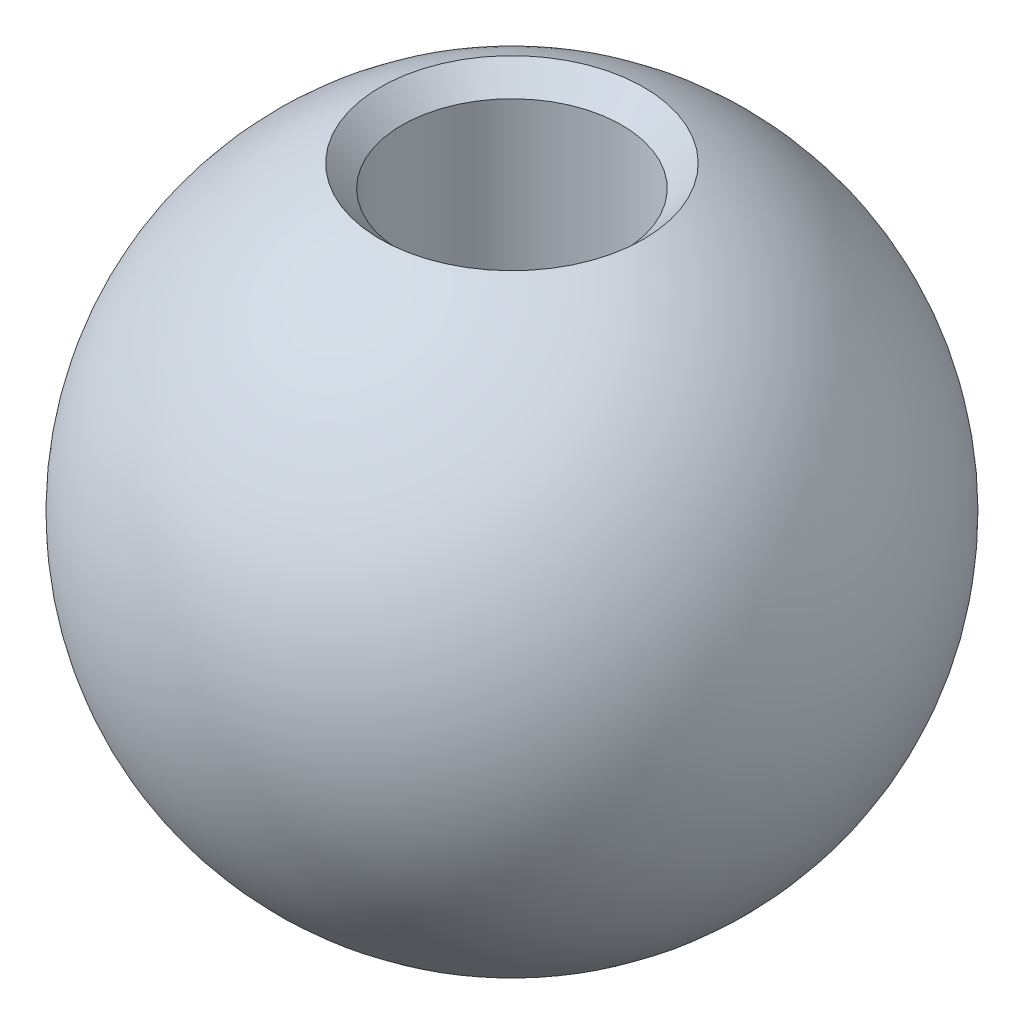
ISO-10303-21;
HEADER;
FILE_DESCRIPTION(('STEP AP214'),'2;1');
FILE_NAME('part.step','',(''),(''),'','','');
FILE_SCHEMA(('AUTOMOTIVE_DESIGN { 1 0 10303 214 1 1 1 1 }'));
ENDSEC;
DATA;
#1=APPLICATION_CONTEXT('core data for automotive mechanical design processes');
#2=APPLICATION_PROTOCOL_DEFINITION('international standard','automotive_design',2000,#1);
#3=PRODUCT_CONTEXT('',#1,'mechanical');
#4=PRODUCT('Part','Part','',(#3));
#5=PRODUCT_RELATED_PRODUCT_CATEGORY('part','',(#4));
#6=PRODUCT_DEFINITION_FORMATION('','',#4);
#7=PRODUCT_DEFINITION_CONTEXT('part definition',#1,'design');
#8=PRODUCT_DEFINITION('design','',#6,#7);
#9=PRODUCT_DEFINITION_SHAPE('','',#8);
#10=(LENGTH_UNIT() NAMED_UNIT(*) SI_UNIT(.MILLI.,.METRE.));
#11=(NAMED_UNIT(*) PLANE_ANGLE_UNIT() SI_UNIT($,.RADIAN.));
#12=(NAMED_UNIT(*) SI_UNIT($,.STERADIAN.) SOLID_ANGLE_UNIT());
#13=UNCERTAINTY_MEASURE_WITH_UNIT(LENGTH_MEASURE(1.E-05),#10,'distance_accuracy_value','');
#14=(GEOMETRIC_REPRESENTATION_CONTEXT(3) GLOBAL_UNCERTAINTY_ASSIGNED_CONTEXT((#13)) GLOBAL_UNIT_ASSIGNED_CONTEXT((#10,
#11,#12)) REPRESENTATION_CONTEXT('',''));
#15=CARTESIAN_POINT('',(0.,0.,0.));
#16=DIRECTION('',(0.,0.,1.));
#17=DIRECTION('',(1.,0.,0.));
#18=AXIS2_PLACEMENT_3D('',#15,#16,#17);
#19=CARTESIAN_POINT('',(0.,0.,0.));
#20=DIRECTION('',(0.,-1.,0.));
#21=DIRECTION('',(1.,0.,0.));
#22=AXIS2_PLACEMENT_3D('',#19,#20,#21);
#23=SPHERICAL_SURFACE('',#22,6.);
#24=CARTESIAN_POINT('',(0.,5.5,0.));
#25=DIRECTION('',(0.,-1.,0.));
#26=DIRECTION('',(1.,0.,0.));
#27=AXIS2_PLACEMENT_3D('',#24,#25,#26);
#28=CIRCLE('',#27,2.39791576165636);
#29=CARTESIAN_POINT('',(2.39791576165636,5.5,0.));
#30=VERTEX_POINT('',#29);
#31=EDGE_CURVE('E10',#30,#30,#28,.T.);
#32=CARTESIAN_POINT('',(0.,-5.5,0.));
#33=DIRECTION('',(0.,-1.,0.));
#34=DIRECTION('',(1.,0.,0.));
#35=AXIS2_PLACEMENT_3D('',#32,#33,#34);
#36=CIRCLE('',#35,2.39791576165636);
#37=CARTESIAN_POINT('',(2.39791576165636,-5.5,0.));
#38=VERTEX_POINT('',#37);
#39=EDGE_CURVE('E45',#38,#38,#36,.T.);
#40=CARTESIAN_POINT('',(2.39791576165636,5.5,0.));
#41=CARTESIAN_POINT('',(2.53079788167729,5.44207621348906,0.));
#42=CARTESIAN_POINT('',(2.66157166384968,5.37931973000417,0.));
#43=CARTESIAN_POINT('',(2.9182361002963,5.24450939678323,0.));
#44=CARTESIAN_POINT('',(3.04412675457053,5.17245554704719,0.));
#45=CARTESIAN_POINT('',(3.29035848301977,5.01941850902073,0.));
#46=CARTESIAN_POINT('',(3.41069955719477,4.93843532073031,0.));
#47=CARTESIAN_POINT('',(3.64520168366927,4.76796760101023,0.));
#48=CARTESIAN_POINT('',(3.75936273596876,4.67848306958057,0.));
#49=CARTESIAN_POINT('',(3.98090498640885,4.4914817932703,0.));
#50=CARTESIAN_POINT('',(4.08828618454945,4.39396504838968,0.));
#51=CARTESIAN_POINT('',(4.29570498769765,4.19141159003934,0.));
#52=CARTESIAN_POINT('',(4.39574259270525,4.08637487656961,0.));
#53=CARTESIAN_POINT('',(4.58794889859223,3.86933296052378,0.));
#54=CARTESIAN_POINT('',(4.68011759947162,3.75732775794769,0.));
#55=CARTESIAN_POINT('',(4.85610214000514,3.52693700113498,0.));
#56=CARTESIAN_POINT('',(4.93991797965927,3.40855144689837,0.));
#57=CARTESIAN_POINT('',(5.09875669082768,3.16602160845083,0.));
#58=CARTESIAN_POINT('',(5.17377956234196,3.04187732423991,0.));
#59=CARTESIAN_POINT('',(5.31463840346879,2.7884818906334,0.));
#60=CARTESIAN_POINT('',(5.38047437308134,2.65923074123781,0.));
#61=CARTESIAN_POINT('',(5.50261371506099,2.39630025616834,0.));
#62=CARTESIAN_POINT('',(5.5589170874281,2.26262092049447,0.));
#63=CARTESIAN_POINT('',(5.66169559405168,1.99153599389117,0.));
#64=CARTESIAN_POINT('',(5.70817072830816,1.85413040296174,0.));
#65=CARTESIAN_POINT('',(5.79104872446,1.57631446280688,0.));
#66=CARTESIAN_POINT('',(5.82745158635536,1.43590411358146,0.));
#67=CARTESIAN_POINT('',(5.88999389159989,1.15281593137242,0.));
#68=CARTESIAN_POINT('',(5.91613333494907,1.0101380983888,0.));
#69=CARTESIAN_POINT('',(5.95801154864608,0.723264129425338,0.));
#70=CARTESIAN_POINT('',(5.97375031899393,0.579067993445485,0.));
#71=CARTESIAN_POINT('',(5.99474454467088,0.289914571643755,0.));
#72=CARTESIAN_POINT('',(6.,0.144957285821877,0.));
#73=CARTESIAN_POINT('',(6.,-0.144957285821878,0.));
#74=CARTESIAN_POINT('',(5.99474454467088,-0.289914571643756,0.));
#75=CARTESIAN_POINT('',(5.97375031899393,-0.579067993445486,0.));
#76=CARTESIAN_POINT('',(5.95801154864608,-0.723264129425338,0.));
#77=CARTESIAN_POINT('',(5.91613333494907,-1.0101380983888,0.));
#78=CARTESIAN_POINT('',(5.88999389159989,-1.15281593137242,0.));
#79=CARTESIAN_POINT('',(5.82745158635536,-1.43590411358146,0.));
#80=CARTESIAN_POINT('',(5.79104872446,-1.57631446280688,0.));
#81=CARTESIAN_POINT('',(5.70817072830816,-1.85413040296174,0.));
#82=CARTESIAN_POINT('',(5.66169559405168,-1.99153599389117,0.));
#83=CARTESIAN_POINT('',(5.5589170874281,-2.26262092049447,0.));
#84=CARTESIAN_POINT('',(5.50261371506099,-2.39630025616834,0.));
#85=CARTESIAN_POINT('',(5.38047437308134,-2.65923074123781,0.));
#86=CARTESIAN_POINT('',(5.31463840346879,-2.7884818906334,0.));
#87=CARTESIAN_POINT('',(5.17377956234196,-3.04187732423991,0.));
#88=CARTESIAN_POINT('',(5.09875669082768,-3.16602160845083,0.));
#89=CARTESIAN_POINT('',(4.93991797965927,-3.40855144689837,0.));
#90=CARTESIAN_POINT('',(4.85610214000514,-3.52693700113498,0.));
#91=CARTESIAN_POINT('',(4.68011759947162,-3.75732775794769,0.));
#92=CARTESIAN_POINT('',(4.58794889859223,-3.86933296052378,0.));
#93=CARTESIAN_POINT('',(4.39574259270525,-4.08637487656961,0.));
#94=CARTESIAN_POINT('',(4.29570498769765,-4.19141159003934,0.));
#95=CARTESIAN_POINT('',(4.08828618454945,-4.39396504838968,0.));
#96=CARTESIAN_POINT('',(3.98090498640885,-4.49148179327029,0.));
#97=CARTESIAN_POINT('',(3.75936273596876,-4.67848306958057,0.));
#98=CARTESIAN_POINT('',(3.64520168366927,-4.76796760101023,0.));
#99=CARTESIAN_POINT('',(3.41069955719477,-4.93843532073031,0.));
#100=CARTESIAN_POINT('',(3.29035848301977,-5.01941850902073,0.));
#101=CARTESIAN_POINT('',(3.04412675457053,-5.17245554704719,0.));
#102=CARTESIAN_POINT('',(2.9182361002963,-5.24450939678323,0.));
#103=CARTESIAN_POINT('',(2.66157166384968,-5.37931973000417,0.));
#104=CARTESIAN_POINT('',(2.53079788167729,-5.44207621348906,0.));
#105=CARTESIAN_POINT('',(2.39791576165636,-5.5,0.));
#106=B_SPLINE_CURVE_WITH_KNOTS('',3,(#40,#41,#42,#43,#44,#45,#46,#47,#48,#49,#50,#51,#52,#53,
#54,#55,#56,#57,#58,#59,#60,#61,#62,#63,#64,#65,#66,#67,#68,#69,#70,#71,#72,#73,#74,#75,#76,#77,
#78,#79,#80,#81,#82,#83,#84,#85,#86,#87,#88,#89,#90,#91,#92,#93,#94,#95,#96,#97,#98,#99,#100,
#101,#102,#103,#104,#105),.UNSPECIFIED.,.F.,.F.,(4,2,2,2,2,2,2,2,2,2,2,2,2,2,2,2,2,2,2,2,2,2,2,
2,2,2,2,2,2,2,2,2,4),(0.,0.434776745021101,0.869553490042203,1.3043302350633,1.73910698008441,
2.17388372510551,2.60866047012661,3.04343721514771,3.47821396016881,3.91299070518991,
4.34776745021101,4.78254419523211,5.21732094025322,5.65209768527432,6.08687443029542,
6.52165117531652,6.95642792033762,7.39120466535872,7.82598141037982,8.26075815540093,
8.69553490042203,9.13031164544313,9.56508839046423,9.99986513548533,10.4346418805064,
10.8694186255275,11.3041953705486,11.7389721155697,12.1737488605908,12.6085256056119,
13.043302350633,13.4780790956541,13.9128558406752),.UNSPECIFIED.);
#107=EDGE_CURVE('BSEAM31',#30,#38,#106,.T.);
#108=ORIENTED_EDGE('',*,*,#31,.T.);
#109=ORIENTED_EDGE('',*,*,#39,.F.);
#110=ORIENTED_EDGE('',*,*,#107,.T.);
#111=ORIENTED_EDGE('',*,*,#107,.F.);
#112=EDGE_LOOP('',(#108,#110,#109,#111));
#113=FACE_BOUND('',#112,.T.);
#114=ADVANCED_FACE('F31',(#113),#23,.T.);
#115=CARTESIAN_POINT('',(0.,5.5,0.));
#116=DIRECTION('',(0.,1.,0.));
#117=DIRECTION('',(-1.,0.,0.));
#118=AXIS2_PLACEMENT_3D('',#115,#116,#117);
#119=CONICAL_SURFACE('',#118,2.39791576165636,0.785398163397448);
#120=CARTESIAN_POINT('',(0.,5.10208423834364,0.));
#121=DIRECTION('',(0.,-1.,0.));
#122=DIRECTION('',(1.,0.,0.));
#123=AXIS2_PLACEMENT_3D('',#120,#121,#122);
#124=CIRCLE('',#123,2.);
#125=CARTESIAN_POINT('',(2.,5.10208423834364,0.));
#126=VERTEX_POINT('',#125);
#127=EDGE_CURVE('E37',#126,#126,#124,.T.);
#128=ORIENTED_EDGE('',*,*,#127,.T.);
#129=EDGE_LOOP('',(#128));
#130=FACE_BOUND('',#129,.T.);
#131=ORIENTED_EDGE('',*,*,#31,.F.);
#132=EDGE_LOOP('',(#131));
#133=FACE_BOUND('',#132,.T.);
#134=ADVANCED_FACE('F55',(#130,#133),#119,.F.);
#135=CARTESIAN_POINT('',(0.,-5.5,0.));
#136=DIRECTION('',(0.,-1.,0.));
#137=DIRECTION('',(1.,0.,0.));
#138=AXIS2_PLACEMENT_3D('',#135,#136,#137);
#139=CYLINDRICAL_SURFACE('',#138,2.);
#140=CARTESIAN_POINT('',(0.,-5.5,0.));
#141=DIRECTION('',(0.,-1.,0.));
#142=DIRECTION('',(1.,0.,0.));
#143=AXIS2_PLACEMENT_3D('',#140,#141,#142);
#144=CIRCLE('',#143,2.);
#145=CARTESIAN_POINT('',(2.,-5.5,0.));
#146=VERTEX_POINT('',#145);
#147=EDGE_CURVE('E41',#146,#146,#144,.T.);
#148=ORIENTED_EDGE('',*,*,#147,.T.);
#149=EDGE_LOOP('',(#148));
#150=FACE_BOUND('',#149,.T.);
#151=ORIENTED_EDGE('',*,*,#127,.F.);
#152=EDGE_LOOP('',(#151));
#153=FACE_BOUND('',#152,.T.);
#154=ADVANCED_FACE('F59',(#150,#153),#139,.F.);
#155=CARTESIAN_POINT('',(2.,-5.5,0.));
#156=DIRECTION('',(0.,-1.,0.));
#157=DIRECTION('',(1.,0.,0.));
#158=AXIS2_PLACEMENT_3D('',#155,#156,#157);
#159=PLANE('',#158);
#160=ORIENTED_EDGE('',*,*,#39,.T.);
#161=EDGE_LOOP('',(#160));
#162=FACE_BOUND('',#161,.T.);
#163=ORIENTED_EDGE('',*,*,#147,.F.);
#164=EDGE_LOOP('',(#163));
#165=FACE_BOUND('',#164,.T.);
#166=ADVANCED_FACE('F51',(#162,#165),#159,.T.);
#167=CLOSED_SHELL('',(#114,#134,#154,#166));
#168=MANIFOLD_SOLID_BREP('B2',#167);
#169=ADVANCED_BREP_SHAPE_REPRESENTATION('',(#18,#168),#14);
#170=SHAPE_DEFINITION_REPRESENTATION(#9,#169);
ENDSEC;
END-ISO-10303-21;
